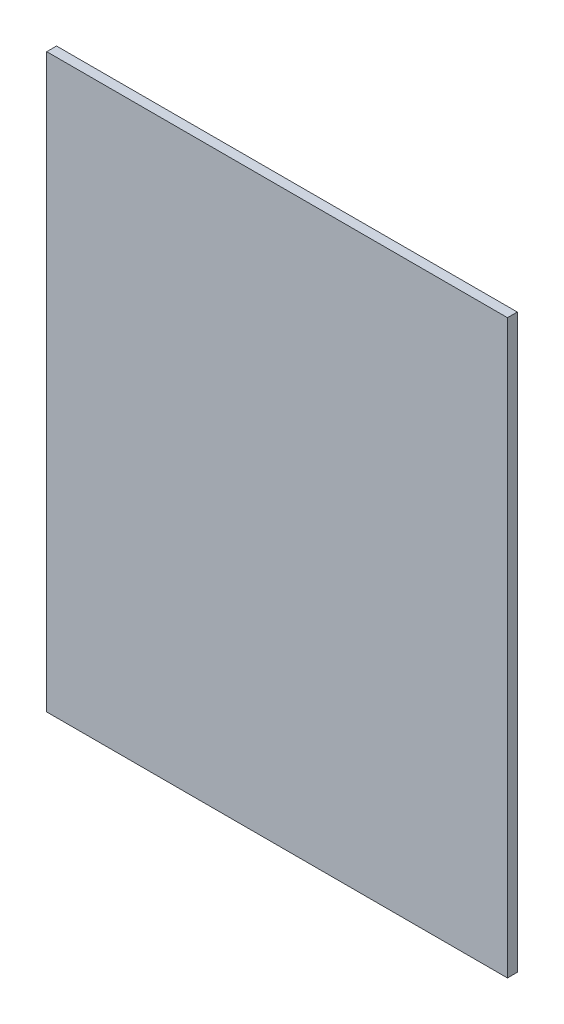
ISO-10303-21;
HEADER;
FILE_DESCRIPTION(('STEP AP214'),'2;1');
FILE_NAME('part.step','',(''),(''),'','','');
FILE_SCHEMA(('AUTOMOTIVE_DESIGN { 1 0 10303 214 1 1 1 1 }'));
ENDSEC;
DATA;
#1=APPLICATION_CONTEXT('core data for automotive mechanical design processes');
#2=APPLICATION_PROTOCOL_DEFINITION('international standard','automotive_design',2000,#1);
#3=PRODUCT_CONTEXT('',#1,'mechanical');
#4=PRODUCT('Part','Part','',(#3));
#5=PRODUCT_RELATED_PRODUCT_CATEGORY('part','',(#4));
#6=PRODUCT_DEFINITION_FORMATION('','',#4);
#7=PRODUCT_DEFINITION_CONTEXT('part definition',#1,'design');
#8=PRODUCT_DEFINITION('design','',#6,#7);
#9=PRODUCT_DEFINITION_SHAPE('','',#8);
#10=(LENGTH_UNIT() NAMED_UNIT(*) SI_UNIT(.MILLI.,.METRE.));
#11=(NAMED_UNIT(*) PLANE_ANGLE_UNIT() SI_UNIT($,.RADIAN.));
#12=(NAMED_UNIT(*) SI_UNIT($,.STERADIAN.) SOLID_ANGLE_UNIT());
#13=UNCERTAINTY_MEASURE_WITH_UNIT(LENGTH_MEASURE(1.E-05),#10,'distance_accuracy_value','');
#14=(GEOMETRIC_REPRESENTATION_CONTEXT(3) GLOBAL_UNCERTAINTY_ASSIGNED_CONTEXT((#13)) GLOBAL_UNIT_ASSIGNED_CONTEXT((#10,
#11,#12)) REPRESENTATION_CONTEXT('',''));
#15=CARTESIAN_POINT('',(0.,0.,0.));
#16=DIRECTION('',(0.,0.,1.));
#17=DIRECTION('',(1.,0.,0.));
#18=AXIS2_PLACEMENT_3D('',#15,#16,#17);
#19=CARTESIAN_POINT('',(70.5,-87.5,3.));
#20=DIRECTION('',(-1.,0.,0.));
#21=DIRECTION('',(0.,0.,1.));
#22=AXIS2_PLACEMENT_3D('',#19,#20,#21);
#23=PLANE('',#22);
#24=DIRECTION('',(0.,1.,0.));
#25=VECTOR('',#24,1.);
#26=CARTESIAN_POINT('',(70.5,-87.5,0.));
#27=LINE('',#26,#25);
#28=CARTESIAN_POINT('',(70.5,-87.5,0.));
#29=VERTEX_POINT('',#28);
#30=CARTESIAN_POINT('',(70.5,87.5,0.));
#31=VERTEX_POINT('',#30);
#32=EDGE_CURVE('E97',#29,#31,#27,.T.);
#33=ORIENTED_EDGE('',*,*,#32,.T.);
#34=DIRECTION('',(0.,0.,-1.));
#35=VECTOR('',#34,1.);
#36=CARTESIAN_POINT('',(70.5,87.5,3.));
#37=LINE('',#36,#35);
#38=CARTESIAN_POINT('',(70.5,87.5,3.));
#39=VERTEX_POINT('',#38);
#40=EDGE_CURVE('E11',#39,#31,#37,.T.);
#41=ORIENTED_EDGE('',*,*,#40,.F.);
#42=DIRECTION('',(0.,1.,0.));
#43=VECTOR('',#42,1.);
#44=CARTESIAN_POINT('',(70.5,-87.5,3.));
#45=LINE('',#44,#43);
#46=CARTESIAN_POINT('',(70.5,-87.5,3.));
#47=VERTEX_POINT('',#46);
#48=EDGE_CURVE('E85',#47,#39,#45,.T.);
#49=ORIENTED_EDGE('',*,*,#48,.F.);
#50=DIRECTION('',(0.,0.,-1.));
#51=VECTOR('',#50,1.);
#52=CARTESIAN_POINT('',(70.5,-87.5,3.));
#53=LINE('',#52,#51);
#54=EDGE_CURVE('E93',#47,#29,#53,.T.);
#55=ORIENTED_EDGE('',*,*,#54,.T.);
#56=EDGE_LOOP('',(#33,#41,#49,#55));
#57=FACE_BOUND('',#56,.T.);
#58=ADVANCED_FACE('F34',(#57),#23,.F.);
#59=CARTESIAN_POINT('',(-70.5,87.5,3.));
#60=DIRECTION('',(0.,-1.,0.));
#61=DIRECTION('',(0.,0.,-1.));
#62=AXIS2_PLACEMENT_3D('',#59,#60,#61);
#63=PLANE('',#62);
#64=DIRECTION('',(-1.,0.,0.));
#65=VECTOR('',#64,1.);
#66=CARTESIAN_POINT('',(-70.5,87.5,0.));
#67=LINE('',#66,#65);
#68=CARTESIAN_POINT('',(-70.5,87.5,0.));
#69=VERTEX_POINT('',#68);
#70=EDGE_CURVE('E89',#31,#69,#67,.T.);
#71=ORIENTED_EDGE('',*,*,#70,.T.);
#72=DIRECTION('',(0.,0.,-1.));
#73=VECTOR('',#72,1.);
#74=CARTESIAN_POINT('',(-70.5,87.5,3.));
#75=LINE('',#74,#73);
#76=CARTESIAN_POINT('',(-70.5,87.5,3.));
#77=VERTEX_POINT('',#76);
#78=EDGE_CURVE('E42',#77,#69,#75,.T.);
#79=ORIENTED_EDGE('',*,*,#78,.F.);
#80=DIRECTION('',(-1.,0.,0.));
#81=VECTOR('',#80,1.);
#82=CARTESIAN_POINT('',(-70.5,87.5,3.));
#83=LINE('',#82,#81);
#84=EDGE_CURVE('E80',#39,#77,#83,.T.);
#85=ORIENTED_EDGE('',*,*,#84,.F.);
#86=ORIENTED_EDGE('',*,*,#40,.T.);
#87=EDGE_LOOP('',(#71,#79,#85,#86));
#88=FACE_BOUND('',#87,.T.);
#89=ADVANCED_FACE('F88',(#88),#63,.F.);
#90=CARTESIAN_POINT('',(-70.5,-87.5,3.));
#91=DIRECTION('',(1.,0.,0.));
#92=DIRECTION('',(0.,0.,-1.));
#93=AXIS2_PLACEMENT_3D('',#90,#91,#92);
#94=PLANE('',#93);
#95=DIRECTION('',(0.,-1.,0.));
#96=VECTOR('',#95,1.);
#97=CARTESIAN_POINT('',(-70.5,-87.5,0.));
#98=LINE('',#97,#96);
#99=CARTESIAN_POINT('',(-70.5,-87.5,0.));
#100=VERTEX_POINT('',#99);
#101=EDGE_CURVE('E67',#69,#100,#98,.T.);
#102=ORIENTED_EDGE('',*,*,#101,.T.);
#103=DIRECTION('',(0.,0.,-1.));
#104=VECTOR('',#103,1.);
#105=CARTESIAN_POINT('',(-70.5,-87.5,3.));
#106=LINE('',#105,#104);
#107=CARTESIAN_POINT('',(-70.5,-87.5,3.));
#108=VERTEX_POINT('',#107);
#109=EDGE_CURVE('E90',#108,#100,#106,.T.);
#110=ORIENTED_EDGE('',*,*,#109,.F.);
#111=DIRECTION('',(0.,-1.,0.));
#112=VECTOR('',#111,1.);
#113=CARTESIAN_POINT('',(-70.5,-87.5,3.));
#114=LINE('',#113,#112);
#115=EDGE_CURVE('E83',#77,#108,#114,.T.);
#116=ORIENTED_EDGE('',*,*,#115,.F.);
#117=ORIENTED_EDGE('',*,*,#78,.T.);
#118=EDGE_LOOP('',(#102,#110,#116,#117));
#119=FACE_BOUND('',#118,.T.);
#120=ADVANCED_FACE('F91',(#119),#94,.F.);
#121=CARTESIAN_POINT('',(-70.5,-87.5,3.));
#122=DIRECTION('',(0.,1.,0.));
#123=DIRECTION('',(0.,0.,1.));
#124=AXIS2_PLACEMENT_3D('',#121,#122,#123);
#125=PLANE('',#124);
#126=DIRECTION('',(1.,0.,0.));
#127=VECTOR('',#126,1.);
#128=CARTESIAN_POINT('',(-70.5,-87.5,0.));
#129=LINE('',#128,#127);
#130=EDGE_CURVE('E73',#100,#29,#129,.T.);
#131=ORIENTED_EDGE('',*,*,#130,.T.);
#132=ORIENTED_EDGE('',*,*,#54,.F.);
#133=DIRECTION('',(1.,0.,0.));
#134=VECTOR('',#133,1.);
#135=CARTESIAN_POINT('',(-70.5,-87.5,3.));
#136=LINE('',#135,#134);
#137=EDGE_CURVE('E50',#108,#47,#136,.T.);
#138=ORIENTED_EDGE('',*,*,#137,.F.);
#139=ORIENTED_EDGE('',*,*,#109,.T.);
#140=EDGE_LOOP('',(#131,#132,#138,#139));
#141=FACE_BOUND('',#140,.T.);
#142=ADVANCED_FACE('F104',(#141),#125,.F.);
#143=CARTESIAN_POINT('',(0.,0.,3.));
#144=DIRECTION('',(0.,0.,-1.));
#145=DIRECTION('',(-1.,0.,0.));
#146=AXIS2_PLACEMENT_3D('',#143,#144,#145);
#147=PLANE('',#146);
#148=ORIENTED_EDGE('',*,*,#48,.T.);
#149=ORIENTED_EDGE('',*,*,#84,.T.);
#150=ORIENTED_EDGE('',*,*,#115,.T.);
#151=ORIENTED_EDGE('',*,*,#137,.T.);
#152=EDGE_LOOP('',(#148,#149,#150,#151));
#153=FACE_BOUND('',#152,.T.);
#154=ADVANCED_FACE('F81',(#153),#147,.F.);
#155=CARTESIAN_POINT('',(0.,0.,0.));
#156=DIRECTION('',(0.,0.,-1.));
#157=DIRECTION('',(-1.,0.,0.));
#158=AXIS2_PLACEMENT_3D('',#155,#156,#157);
#159=PLANE('',#158);
#160=ORIENTED_EDGE('',*,*,#32,.F.);
#161=ORIENTED_EDGE('',*,*,#130,.F.);
#162=ORIENTED_EDGE('',*,*,#101,.F.);
#163=ORIENTED_EDGE('',*,*,#70,.F.);
#164=EDGE_LOOP('',(#160,#161,#162,#163));
#165=FACE_BOUND('',#164,.T.);
#166=ADVANCED_FACE('F107',(#165),#159,.T.);
#167=CLOSED_SHELL('',(#58,#89,#120,#142,#154,#166));
#168=MANIFOLD_SOLID_BREP('B2',#167);
#169=ADVANCED_BREP_SHAPE_REPRESENTATION('',(#18,#168),#14);
#170=SHAPE_DEFINITION_REPRESENTATION(#9,#169);
ENDSEC;
END-ISO-10303-21;
